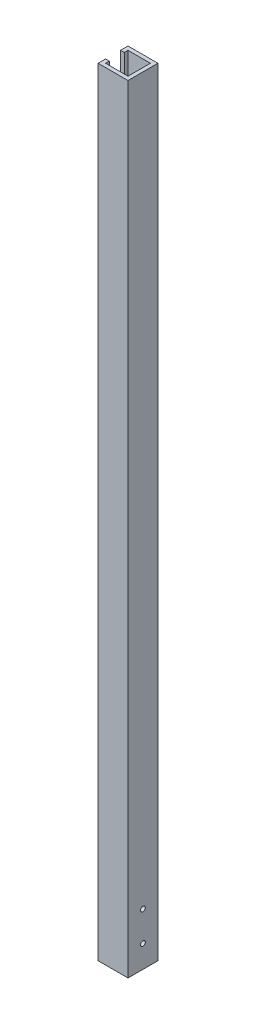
from build123d import *

# Parameters (mm, degrees)
SKETCH1_W              = 25.4
SKETCH1_H              = 25.4
SKETCH1_W_2            = 19.05
SKETCH1_H_2            = 19.05
BOSS_EXTRUDE1_DEPTH    = 660.4
F_10_32_TAPPED_HOLE1_D = 4.0386
SKETCH6_W              = 12.7
SKETCH6_H              = 63.5
CUT_EXTRUDE1_DEPTH     = 3.175
CUT_EXTRUDE9_REACH     = 663.01


with BuildPart() as part:
    # Sketch1 → Boss-Extrude1 (new body)
    with BuildSketch(Plane(origin=(0, 0, 0), x_dir=(1, 0, 0), z_dir=(0, 1, 0))):
        Rectangle(SKETCH1_W, SKETCH1_H)
        Rectangle(SKETCH1_W_2, SKETCH1_H_2, mode=Mode.SUBTRACT)
    extrude(amount=BOSS_EXTRUDE1_DEPTH)

    # 10-32 Tapped Hole1 (through all)
    with Locations(Plane(origin=(12.7, 0, 0), x_dir=(0, 0, -1), z_dir=(1, 0, 0))):
        with Locations((0, 44.45), (0, 19.05)):
            Hole(F_10_32_TAPPED_HOLE1_D / 2)

    # Sketch6 → Cut-Extrude1 (cut)
    with BuildSketch(Plane.ZY.offset(12.7)):
        with Locations((0, 628.65)):
            Rectangle(SKETCH6_W, SKETCH6_H)
    extrude(amount=-CUT_EXTRUDE1_DEPTH, mode=Mode.SUBTRACT)

    # Sketch7 → Cut-Extrude9 (cut, up to next)
    with BuildSketch(Plane(origin=(0, 0, -12.7), x_dir=(-1, 0, 0), z_dir=(0, 0, -1)), mode=Mode.PRIVATE) as cut_extrude9_sk1:
        with BuildLine():
            Line((-8.89, 0), (-8.89, 25.4))
            ThreePointArc((-8.89, 25.4), (0, 34.29), (8.89, 25.4))
            Line((8.89, 25.4), (8.89, 0))
            ThreePointArc((8.89, 0), (0, -8.89), (-8.89, 0))
        make_face()
    cut_extrude9_tool1 = extrude(cut_extrude9_sk1.sketch, amount=-CUT_EXTRUDE9_REACH, mode=Mode.PRIVATE) & part.part
    add(cut_extrude9_tool1.solids().sort_by_distance((0, 12.7, -12.7))[0], mode=Mode.SUBTRACT)


solid = part.part
